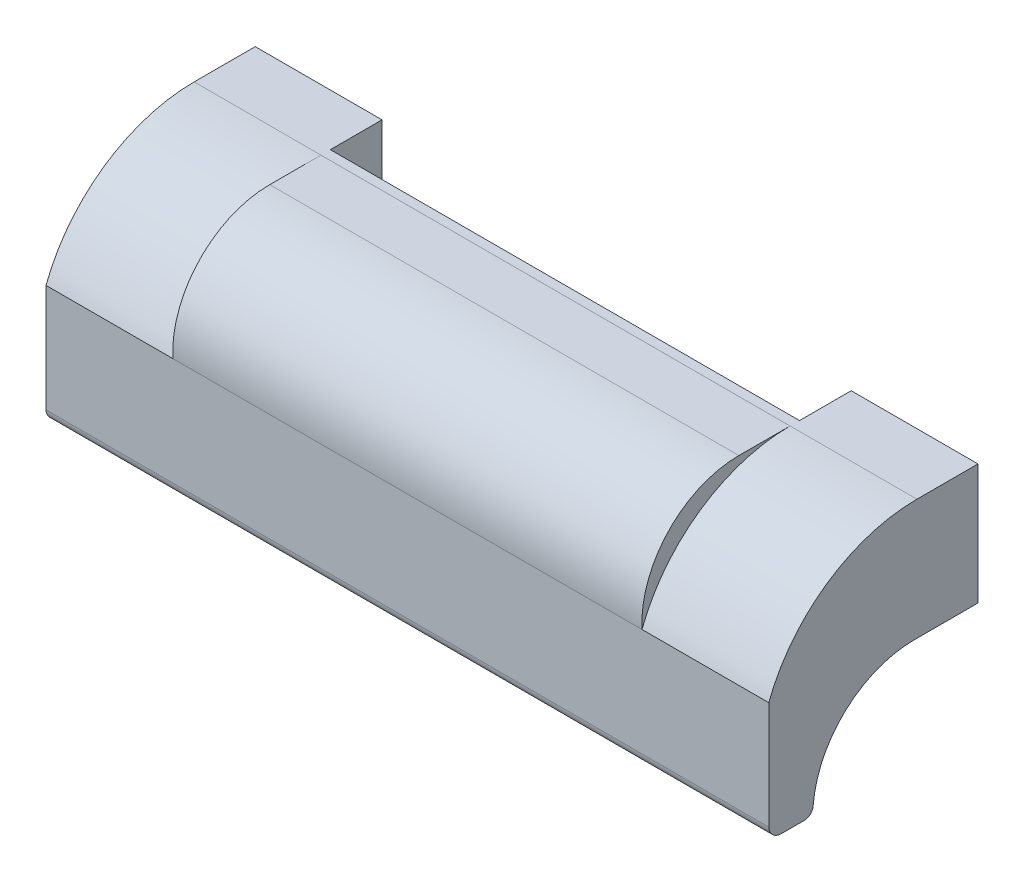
ISO-10303-21;
HEADER;
FILE_DESCRIPTION(('STEP AP214'),'2;1');
FILE_NAME('part.step','',(''),(''),'','','');
FILE_SCHEMA(('AUTOMOTIVE_DESIGN { 1 0 10303 214 1 1 1 1 }'));
ENDSEC;
DATA;
#1=APPLICATION_CONTEXT('core data for automotive mechanical design processes');
#2=APPLICATION_PROTOCOL_DEFINITION('international standard','automotive_design',2000,#1);
#3=PRODUCT_CONTEXT('',#1,'mechanical');
#4=PRODUCT('Part','Part','',(#3));
#5=PRODUCT_RELATED_PRODUCT_CATEGORY('part','',(#4));
#6=PRODUCT_DEFINITION_FORMATION('','',#4);
#7=PRODUCT_DEFINITION_CONTEXT('part definition',#1,'design');
#8=PRODUCT_DEFINITION('design','',#6,#7);
#9=PRODUCT_DEFINITION_SHAPE('','',#8);
#10=(LENGTH_UNIT() NAMED_UNIT(*) SI_UNIT(.MILLI.,.METRE.));
#11=(NAMED_UNIT(*) PLANE_ANGLE_UNIT() SI_UNIT($,.RADIAN.));
#12=(NAMED_UNIT(*) SI_UNIT($,.STERADIAN.) SOLID_ANGLE_UNIT());
#13=UNCERTAINTY_MEASURE_WITH_UNIT(LENGTH_MEASURE(1.E-05),#10,'distance_accuracy_value','');
#14=(GEOMETRIC_REPRESENTATION_CONTEXT(3) GLOBAL_UNCERTAINTY_ASSIGNED_CONTEXT((#13)) GLOBAL_UNIT_ASSIGNED_CONTEXT((#10,
#11,#12)) REPRESENTATION_CONTEXT('',''));
#15=CARTESIAN_POINT('',(0.,0.,0.));
#16=DIRECTION('',(0.,0.,1.));
#17=DIRECTION('',(1.,0.,0.));
#18=AXIS2_PLACEMENT_3D('',#15,#16,#17);
#19=CARTESIAN_POINT('',(-10.25,-9.49999999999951,0.));
#20=DIRECTION('',(0.,0.,-1.));
#21=DIRECTION('',(1.,0.,0.));
#22=AXIS2_PLACEMENT_3D('',#19,#20,#21);
#23=PLANE('',#22);
#24=DIRECTION('',(1.,0.,0.));
#25=VECTOR('',#24,1.);
#26=CARTESIAN_POINT('',(-10.25,-9.49999999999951,0.));
#27=LINE('',#26,#25);
#28=CARTESIAN_POINT('',(83.75,-9.49999999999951,0.));
#29=VERTEX_POINT('',#28);
#30=CARTESIAN_POINT('',(103.75,-9.49999999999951,0.));
#31=VERTEX_POINT('',#30);
#32=EDGE_CURVE('E211',#29,#31,#27,.T.);
#33=ORIENTED_EDGE('',*,*,#32,.F.);
#34=DIRECTION('',(0.,-1.,0.));
#35=VECTOR('',#34,1.);
#36=CARTESIAN_POINT('',(83.75,11.8276139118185,0.));
#37=LINE('',#36,#35);
#38=CARTESIAN_POINT('',(83.75,9.5,0.));
#39=VERTEX_POINT('',#38);
#40=EDGE_CURVE('E504',#39,#29,#37,.T.);
#41=ORIENTED_EDGE('',*,*,#40,.F.);
#42=DIRECTION('',(1.,0.,0.));
#43=VECTOR('',#42,1.);
#44=CARTESIAN_POINT('',(-10.25,9.5,0.));
#45=LINE('',#44,#43);
#46=CARTESIAN_POINT('',(103.75,9.5,0.));
#47=VERTEX_POINT('',#46);
#48=EDGE_CURVE('E210',#39,#47,#45,.T.);
#49=ORIENTED_EDGE('',*,*,#48,.T.);
#50=DIRECTION('',(0.,1.,0.));
#51=VECTOR('',#50,1.);
#52=CARTESIAN_POINT('',(103.75,-9.49999999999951,0.));
#53=LINE('',#52,#51);
#54=EDGE_CURVE('E240',#31,#47,#53,.T.);
#55=ORIENTED_EDGE('',*,*,#54,.F.);
#56=EDGE_LOOP('',(#33,#41,#49,#55));
#57=FACE_BOUND('',#56,.T.);
#58=CARTESIAN_POINT('',(93.5,0.,0.));
#59=DIRECTION('',(0.,0.,1.));
#60=DIRECTION('',(-1.,0.,0.));
#61=AXIS2_PLACEMENT_3D('',#58,#59,#60);
#62=CIRCLE('',#61,3.25);
#63=CARTESIAN_POINT('',(90.25,0.,0.));
#64=VERTEX_POINT('',#63);
#65=EDGE_CURVE('E482',#64,#64,#62,.T.);
#66=ORIENTED_EDGE('',*,*,#65,.T.);
#67=EDGE_LOOP('',(#66));
#68=FACE_BOUND('',#67,.T.);
#69=ADVANCED_FACE('F14',(#57,#68),#23,.T.);
#70=DIRECTION('',(0.,-1.,0.));
#71=VECTOR('',#70,1.);
#72=CARTESIAN_POINT('',(9.75,11.8276139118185,0.));
#73=LINE('',#72,#71);
#74=CARTESIAN_POINT('',(9.75,9.5,0.));
#75=VERTEX_POINT('',#74);
#76=CARTESIAN_POINT('',(9.75,-9.49999999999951,0.));
#77=VERTEX_POINT('',#76);
#78=EDGE_CURVE('E189',#75,#77,#73,.T.);
#79=ORIENTED_EDGE('',*,*,#78,.T.);
#80=CARTESIAN_POINT('',(-10.25,-9.49999999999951,0.));
#81=VERTEX_POINT('',#80);
#82=EDGE_CURVE('E200',#81,#77,#27,.T.);
#83=ORIENTED_EDGE('',*,*,#82,.F.);
#84=DIRECTION('',(0.,1.,0.));
#85=VECTOR('',#84,1.);
#86=CARTESIAN_POINT('',(-10.25,-9.49999999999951,0.));
#87=LINE('',#86,#85);
#88=CARTESIAN_POINT('',(-10.25,9.5,0.));
#89=VERTEX_POINT('',#88);
#90=EDGE_CURVE('E265',#81,#89,#87,.T.);
#91=ORIENTED_EDGE('',*,*,#90,.T.);
#92=EDGE_CURVE('E202',#89,#75,#45,.T.);
#93=ORIENTED_EDGE('',*,*,#92,.T.);
#94=EDGE_LOOP('',(#79,#83,#91,#93));
#95=FACE_BOUND('',#94,.T.);
#96=CARTESIAN_POINT('',(0.,0.,0.));
#97=DIRECTION('',(0.,0.,-1.));
#98=DIRECTION('',(1.,0.,0.));
#99=AXIS2_PLACEMENT_3D('',#96,#97,#98);
#100=CIRCLE('',#99,3.25);
#101=CARTESIAN_POINT('',(3.25,0.,0.));
#102=VERTEX_POINT('',#101);
#103=EDGE_CURVE('E203',#102,#102,#100,.T.);
#104=ORIENTED_EDGE('',*,*,#103,.F.);
#105=EDGE_LOOP('',(#104));
#106=FACE_BOUND('',#105,.T.);
#107=ADVANCED_FACE('F197',(#95,#106),#23,.T.);
#108=CARTESIAN_POINT('',(-10.25,9.5,0.));
#109=DIRECTION('',(0.,1.,0.));
#110=DIRECTION('',(-1.,0.,0.));
#111=AXIS2_PLACEMENT_3D('',#108,#109,#110);
#112=PLANE('',#111);
#113=ORIENTED_EDGE('',*,*,#48,.F.);
#114=DIRECTION('',(0.,0.,1.));
#115=VECTOR('',#114,1.);
#116=CARTESIAN_POINT('',(83.75,9.5,0.));
#117=LINE('',#116,#115);
#118=CARTESIAN_POINT('',(83.75,9.5,8.15107299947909));
#119=VERTEX_POINT('',#118);
#120=EDGE_CURVE('E530',#39,#119,#117,.T.);
#121=ORIENTED_EDGE('',*,*,#120,.T.);
#122=DIRECTION('',(1.,0.,0.));
#123=VECTOR('',#122,1.);
#124=CARTESIAN_POINT('',(-10.25,9.5,8.15107299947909));
#125=LINE('',#124,#123);
#126=CARTESIAN_POINT('',(9.75,9.5,8.15107299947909));
#127=VERTEX_POINT('',#126);
#128=EDGE_CURVE('E9',#127,#119,#125,.T.);
#129=ORIENTED_EDGE('',*,*,#128,.F.);
#130=DIRECTION('',(0.,0.,1.));
#131=VECTOR('',#130,1.);
#132=CARTESIAN_POINT('',(9.75,9.5,0.));
#133=LINE('',#132,#131);
#134=EDGE_CURVE('E528',#75,#127,#133,.T.);
#135=ORIENTED_EDGE('',*,*,#134,.F.);
#136=ORIENTED_EDGE('',*,*,#92,.F.);
#137=DIRECTION('',(0.,0.,1.));
#138=VECTOR('',#137,1.);
#139=CARTESIAN_POINT('',(-10.25,9.5,0.));
#140=LINE('',#139,#138);
#141=CARTESIAN_POINT('',(-10.25,9.5,9.6333620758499));
#142=VERTEX_POINT('',#141);
#143=EDGE_CURVE('E226',#89,#142,#140,.T.);
#144=ORIENTED_EDGE('',*,*,#143,.T.);
#145=DIRECTION('',(1.,0.,0.));
#146=VECTOR('',#145,1.);
#147=CARTESIAN_POINT('',(-10.25,9.5,9.6333620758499));
#148=LINE('',#147,#146);
#149=CARTESIAN_POINT('',(103.75,9.5,9.6333620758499));
#150=VERTEX_POINT('',#149);
#151=EDGE_CURVE('E23',#142,#150,#148,.T.);
#152=ORIENTED_EDGE('',*,*,#151,.T.);
#153=DIRECTION('',(0.,0.,1.));
#154=VECTOR('',#153,1.);
#155=CARTESIAN_POINT('',(103.75,9.5,0.));
#156=LINE('',#155,#154);
#157=EDGE_CURVE('E223',#47,#150,#156,.T.);
#158=ORIENTED_EDGE('',*,*,#157,.F.);
#159=EDGE_LOOP('',(#113,#121,#129,#135,#136,#144,#152,#158));
#160=FACE_BOUND('',#159,.T.);
#161=ADVANCED_FACE('F16',(#160),#112,.T.);
#162=CARTESIAN_POINT('',(-10.25,-9.49999999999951,0.));
#163=DIRECTION('',(0.,1.,0.));
#164=DIRECTION('',(-1.,0.,0.));
#165=AXIS2_PLACEMENT_3D('',#162,#163,#164);
#166=PLANE('',#165);
#167=DIRECTION('',(0.,0.,-1.));
#168=VECTOR('',#167,1.);
#169=CARTESIAN_POINT('',(83.75,-9.5,25.254590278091));
#170=LINE('',#169,#168);
#171=CARTESIAN_POINT('',(83.75,-9.5,25.254590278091));
#172=VERTEX_POINT('',#171);
#173=EDGE_CURVE('E506',#172,#29,#170,.T.);
#174=ORIENTED_EDGE('',*,*,#173,.T.);
#175=ORIENTED_EDGE('',*,*,#32,.T.);
#176=DIRECTION('',(0.,0.,1.));
#177=VECTOR('',#176,1.);
#178=CARTESIAN_POINT('',(103.75,-9.49999999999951,0.));
#179=LINE('',#178,#177);
#180=CARTESIAN_POINT('',(103.75,-9.49999999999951,10.0519430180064));
#181=VERTEX_POINT('',#180);
#182=EDGE_CURVE('E242',#31,#181,#179,.T.);
#183=ORIENTED_EDGE('',*,*,#182,.T.);
#184=DIRECTION('',(1.,0.,0.));
#185=VECTOR('',#184,1.);
#186=CARTESIAN_POINT('',(-10.25,-9.49999999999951,10.0519430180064));
#187=LINE('',#186,#185);
#188=CARTESIAN_POINT('',(101.25,-9.49999999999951,10.0519430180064));
#189=VERTEX_POINT('',#188);
#190=EDGE_CURVE('E293',#189,#181,#187,.T.);
#191=ORIENTED_EDGE('',*,*,#190,.F.);
#192=DIRECTION('',(0.,0.,1.));
#193=VECTOR('',#192,1.);
#194=CARTESIAN_POINT('',(101.25,-9.49999999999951,-0.00996209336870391));
#195=LINE('',#194,#193);
#196=CARTESIAN_POINT('',(101.25,-9.49999999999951,30.));
#197=VERTEX_POINT('',#196);
#198=EDGE_CURVE('E546',#189,#197,#195,.T.);
#199=ORIENTED_EDGE('',*,*,#198,.T.);
#200=DIRECTION('',(-1.,0.,0.));
#201=VECTOR('',#200,1.);
#202=CARTESIAN_POINT('',(101.25,-9.49999999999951,30.));
#203=LINE('',#202,#201);
#204=CARTESIAN_POINT('',(-7.75,-9.49999999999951,30.));
#205=VERTEX_POINT('',#204);
#206=EDGE_CURVE('E324',#197,#205,#203,.T.);
#207=ORIENTED_EDGE('',*,*,#206,.T.);
#208=DIRECTION('',(0.,0.,1.));
#209=VECTOR('',#208,1.);
#210=CARTESIAN_POINT('',(-7.75,-9.49999999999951,-0.00996209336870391));
#211=LINE('',#210,#209);
#212=CARTESIAN_POINT('',(-7.75,-9.49999999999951,10.0519430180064));
#213=VERTEX_POINT('',#212);
#214=EDGE_CURVE('E533',#213,#205,#211,.T.);
#215=ORIENTED_EDGE('',*,*,#214,.F.);
#216=CARTESIAN_POINT('',(-10.25,-9.49999999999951,10.0519430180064));
#217=VERTEX_POINT('',#216);
#218=EDGE_CURVE('E214',#217,#213,#187,.T.);
#219=ORIENTED_EDGE('',*,*,#218,.F.);
#220=DIRECTION('',(0.,0.,1.));
#221=VECTOR('',#220,1.);
#222=CARTESIAN_POINT('',(-10.25,-9.49999999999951,0.));
#223=LINE('',#222,#221);
#224=EDGE_CURVE('E209',#81,#217,#223,.T.);
#225=ORIENTED_EDGE('',*,*,#224,.F.);
#226=ORIENTED_EDGE('',*,*,#82,.T.);
#227=DIRECTION('',(0.,0.,-1.));
#228=VECTOR('',#227,1.);
#229=CARTESIAN_POINT('',(9.75,-9.5,25.254590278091));
#230=LINE('',#229,#228);
#231=CARTESIAN_POINT('',(9.75,-9.49999999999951,25.254590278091));
#232=VERTEX_POINT('',#231);
#233=EDGE_CURVE('E186',#232,#77,#230,.T.);
#234=ORIENTED_EDGE('',*,*,#233,.F.);
#235=DIRECTION('',(-1.,0.,0.));
#236=VECTOR('',#235,1.);
#237=CARTESIAN_POINT('',(83.75,-9.5,25.254590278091));
#238=LINE('',#237,#236);
#239=EDGE_CURVE('E520',#172,#232,#238,.T.);
#240=ORIENTED_EDGE('',*,*,#239,.F.);
#241=EDGE_LOOP('',(#174,#175,#183,#191,#199,#207,#215,#219,#225,#226,#234,#240));
#242=FACE_BOUND('',#241,.T.);
#243=ADVANCED_FACE('F207',(#242),#166,.F.);
#244=CARTESIAN_POINT('',(-10.25,-25.4999999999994,10.0519430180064));
#245=DIRECTION('',(1.,0.,0.));
#246=DIRECTION('',(0.,1.,0.));
#247=AXIS2_PLACEMENT_3D('',#244,#245,#246);
#248=CYLINDRICAL_SURFACE('',#247,16.);
#249=DIRECTION('',(1.,0.,0.));
#250=VECTOR('',#249,1.);
#251=CARTESIAN_POINT('',(-10.25,-24.2117925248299,26.));
#252=LINE('',#251,#250);
#253=CARTESIAN_POINT('',(101.25,-24.2117925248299,26.));
#254=VERTEX_POINT('',#253);
#255=CARTESIAN_POINT('',(103.75,-24.2117925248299,26.));
#256=VERTEX_POINT('',#255);
#257=EDGE_CURVE('E290',#254,#256,#252,.T.);
#258=ORIENTED_EDGE('',*,*,#257,.F.);
#259=CARTESIAN_POINT('',(101.25,-25.4999999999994,10.0519430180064));
#260=DIRECTION('',(-1.,0.,0.));
#261=DIRECTION('',(0.,-1.,0.));
#262=AXIS2_PLACEMENT_3D('',#259,#260,#261);
#263=CIRCLE('',#262,16.);
#264=EDGE_CURVE('E323',#254,#189,#263,.T.);
#265=ORIENTED_EDGE('',*,*,#264,.T.);
#266=ORIENTED_EDGE('',*,*,#190,.T.);
#267=CARTESIAN_POINT('',(103.75,-25.4999999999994,10.0519430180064));
#268=DIRECTION('',(-1.,0.,0.));
#269=DIRECTION('',(0.,-1.,0.));
#270=AXIS2_PLACEMENT_3D('',#267,#268,#269);
#271=CIRCLE('',#270,16.);
#272=EDGE_CURVE('E248',#256,#181,#271,.T.);
#273=ORIENTED_EDGE('',*,*,#272,.F.);
#274=EDGE_LOOP('',(#258,#265,#266,#273));
#275=FACE_BOUND('',#274,.T.);
#276=ADVANCED_FACE('F305',(#275),#248,.F.);
#277=CARTESIAN_POINT('',(-10.25,-15.5,9.6333620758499));
#278=DIRECTION('',(1.,0.,0.));
#279=DIRECTION('',(0.,1.,0.));
#280=AXIS2_PLACEMENT_3D('',#277,#278,#279);
#281=CYLINDRICAL_SURFACE('',#280,25.);
#282=DIRECTION('',(1.,0.,0.));
#283=VECTOR('',#282,1.);
#284=CARTESIAN_POINT('',(-10.25,-6.61179252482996,33.));
#285=LINE('',#284,#283);
#286=CARTESIAN_POINT('',(-10.25,-6.61179252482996,33.));
#287=VERTEX_POINT('',#286);
#288=CARTESIAN_POINT('',(9.75,-6.61179252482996,33.));
#289=VERTEX_POINT('',#288);
#290=EDGE_CURVE('E283',#287,#289,#285,.T.);
#291=ORIENTED_EDGE('',*,*,#290,.T.);
#292=CARTESIAN_POINT('',(9.75,-15.5,9.6333620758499));
#293=DIRECTION('',(-1.,0.,0.));
#294=DIRECTION('',(0.,-1.,0.));
#295=AXIS2_PLACEMENT_3D('',#292,#293,#294);
#296=CIRCLE('',#295,25.);
#297=CARTESIAN_POINT('',(9.75,9.49999752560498,9.64909228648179));
#298=VERTEX_POINT('',#297);
#299=EDGE_CURVE('E42',#289,#298,#296,.T.);
#300=ORIENTED_EDGE('',*,*,#299,.T.);
#301=DIRECTION('',(1.,0.,0.));
#302=VECTOR('',#301,1.);
#303=CARTESIAN_POINT('',(9.75,9.5,9.6490922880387));
#304=LINE('',#303,#302);
#305=CARTESIAN_POINT('',(83.75,9.49999752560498,9.64909228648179));
#306=VERTEX_POINT('',#305);
#307=EDGE_CURVE('E46',#298,#306,#304,.T.);
#308=ORIENTED_EDGE('',*,*,#307,.T.);
#309=CARTESIAN_POINT('',(83.75,-15.5,9.6333620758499));
#310=DIRECTION('',(-1.,0.,0.));
#311=DIRECTION('',(0.,-1.,0.));
#312=AXIS2_PLACEMENT_3D('',#309,#310,#311);
#313=CIRCLE('',#312,25.);
#314=CARTESIAN_POINT('',(83.75,-6.61179252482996,33.));
#315=VERTEX_POINT('',#314);
#316=EDGE_CURVE('E343',#315,#306,#313,.T.);
#317=ORIENTED_EDGE('',*,*,#316,.F.);
#318=CARTESIAN_POINT('',(103.75,-6.61179252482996,33.));
#319=VERTEX_POINT('',#318);
#320=EDGE_CURVE('E232',#315,#319,#285,.T.);
#321=ORIENTED_EDGE('',*,*,#320,.T.);
#322=CARTESIAN_POINT('',(103.75,-15.5,9.6333620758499));
#323=DIRECTION('',(-1.,0.,0.));
#324=DIRECTION('',(0.,-1.,0.));
#325=AXIS2_PLACEMENT_3D('',#322,#323,#324);
#326=CIRCLE('',#325,25.);
#327=EDGE_CURVE('E230',#319,#150,#326,.T.);
#328=ORIENTED_EDGE('',*,*,#327,.T.);
#329=ORIENTED_EDGE('',*,*,#151,.F.);
#330=CARTESIAN_POINT('',(-10.25,-15.5,9.6333620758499));
#331=DIRECTION('',(-1.,0.,0.));
#332=DIRECTION('',(0.,-1.,0.));
#333=AXIS2_PLACEMENT_3D('',#330,#331,#332);
#334=CIRCLE('',#333,25.);
#335=EDGE_CURVE('E262',#287,#142,#334,.T.);
#336=ORIENTED_EDGE('',*,*,#335,.F.);
#337=EDGE_LOOP('',(#291,#300,#308,#317,#321,#328,#329,#336));
#338=FACE_BOUND('',#337,.T.);
#339=ADVANCED_FACE('F231',(#338),#281,.T.);
#340=CARTESIAN_POINT('',(-7.75,-25.4999999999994,10.0519430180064));
#341=DIRECTION('',(-1.,0.,0.));
#342=DIRECTION('',(0.,-1.,0.));
#343=AXIS2_PLACEMENT_3D('',#340,#341,#342);
#344=CIRCLE('',#343,16.);
#345=CARTESIAN_POINT('',(-7.75,-24.2117925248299,26.));
#346=VERTEX_POINT('',#345);
#347=EDGE_CURVE('E319',#346,#213,#344,.T.);
#348=ORIENTED_EDGE('',*,*,#347,.F.);
#349=CARTESIAN_POINT('',(-10.25,-24.2117925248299,26.));
#350=VERTEX_POINT('',#349);
#351=EDGE_CURVE('E291',#350,#346,#252,.T.);
#352=ORIENTED_EDGE('',*,*,#351,.F.);
#353=CARTESIAN_POINT('',(-10.25,-25.4999999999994,10.0519430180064));
#354=DIRECTION('',(-1.,0.,0.));
#355=DIRECTION('',(0.,-1.,0.));
#356=AXIS2_PLACEMENT_3D('',#353,#354,#355);
#357=CIRCLE('',#356,16.);
#358=EDGE_CURVE('E268',#350,#217,#357,.T.);
#359=ORIENTED_EDGE('',*,*,#358,.T.);
#360=ORIENTED_EDGE('',*,*,#218,.T.);
#361=EDGE_LOOP('',(#348,#352,#359,#360));
#362=FACE_BOUND('',#361,.T.);
#363=ADVANCED_FACE('F318',(#362),#248,.F.);
#364=CARTESIAN_POINT('',(-10.25,-24.0989933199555,27.3964583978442));
#365=DIRECTION('',(1.,0.,0.));
#366=DIRECTION('',(0.,1.,0.));
#367=AXIS2_PLACEMENT_3D('',#364,#365,#366);
#368=CYLINDRICAL_SURFACE('',#367,1.40100668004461);
#369=DIRECTION('',(1.,0.,0.));
#370=VECTOR('',#369,1.);
#371=CARTESIAN_POINT('',(-10.25,-25.5,27.3964583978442));
#372=LINE('',#371,#370);
#373=CARTESIAN_POINT('',(-10.25,-25.5,27.3964583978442));
#374=VERTEX_POINT('',#373);
#375=CARTESIAN_POINT('',(103.75,-25.5,27.3964583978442));
#376=VERTEX_POINT('',#375);
#377=EDGE_CURVE('E289',#374,#376,#372,.T.);
#378=ORIENTED_EDGE('',*,*,#377,.F.);
#379=CARTESIAN_POINT('',(-10.25,-24.0989933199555,27.3964583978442));
#380=DIRECTION('',(-1.,0.,0.));
#381=DIRECTION('',(0.,-1.,0.));
#382=AXIS2_PLACEMENT_3D('',#379,#380,#381);
#383=CIRCLE('',#382,1.40100668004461);
#384=EDGE_CURVE('E271',#350,#374,#383,.T.);
#385=ORIENTED_EDGE('',*,*,#384,.F.);
#386=ORIENTED_EDGE('',*,*,#351,.T.);
#387=DIRECTION('',(-1.,0.,0.));
#388=VECTOR('',#387,1.);
#389=CARTESIAN_POINT('',(101.25,-24.2117925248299,26.));
#390=LINE('',#389,#388);
#391=EDGE_CURVE('E302',#254,#346,#390,.T.);
#392=ORIENTED_EDGE('',*,*,#391,.F.);
#393=ORIENTED_EDGE('',*,*,#257,.T.);
#394=CARTESIAN_POINT('',(103.75,-24.0989933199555,27.3964583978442));
#395=DIRECTION('',(-1.,0.,0.));
#396=DIRECTION('',(0.,-1.,0.));
#397=AXIS2_PLACEMENT_3D('',#394,#395,#396);
#398=CIRCLE('',#397,1.40100668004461);
#399=EDGE_CURVE('E251',#256,#376,#398,.T.);
#400=ORIENTED_EDGE('',*,*,#399,.T.);
#401=EDGE_LOOP('',(#378,#385,#386,#392,#393,#400));
#402=FACE_BOUND('',#401,.T.);
#403=ADVANCED_FACE('F299',(#402),#368,.T.);
#404=CARTESIAN_POINT('',(-10.25,-25.5,27.3964583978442));
#405=DIRECTION('',(0.,1.,0.));
#406=DIRECTION('',(-1.,0.,0.));
#407=AXIS2_PLACEMENT_3D('',#404,#405,#406);
#408=PLANE('',#407);
#409=DIRECTION('',(1.,0.,0.));
#410=VECTOR('',#409,1.);
#411=CARTESIAN_POINT('',(-10.25,-25.5,31.0031268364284));
#412=LINE('',#411,#410);
#413=CARTESIAN_POINT('',(-10.25,-25.5,31.0031268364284));
#414=VERTEX_POINT('',#413);
#415=CARTESIAN_POINT('',(103.75,-25.5,31.0031268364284));
#416=VERTEX_POINT('',#415);
#417=EDGE_CURVE('E287',#414,#416,#412,.T.);
#418=ORIENTED_EDGE('',*,*,#417,.F.);
#419=DIRECTION('',(0.,0.,1.));
#420=VECTOR('',#419,1.);
#421=CARTESIAN_POINT('',(-10.25,-25.5,27.3964583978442));
#422=LINE('',#421,#420);
#423=EDGE_CURVE('E274',#374,#414,#422,.T.);
#424=ORIENTED_EDGE('',*,*,#423,.F.);
#425=ORIENTED_EDGE('',*,*,#377,.T.);
#426=DIRECTION('',(0.,0.,1.));
#427=VECTOR('',#426,1.);
#428=CARTESIAN_POINT('',(103.75,-25.5,27.3964583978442));
#429=LINE('',#428,#427);
#430=EDGE_CURVE('E254',#376,#416,#429,.T.);
#431=ORIENTED_EDGE('',*,*,#430,.T.);
#432=EDGE_LOOP('',(#418,#424,#425,#431));
#433=FACE_BOUND('',#432,.T.);
#434=ADVANCED_FACE('F309',(#433),#408,.F.);
#435=CARTESIAN_POINT('',(-10.25,-23.5,31.0031268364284));
#436=DIRECTION('',(1.,0.,0.));
#437=DIRECTION('',(0.,1.,0.));
#438=AXIS2_PLACEMENT_3D('',#435,#436,#437);
#439=CYLINDRICAL_SURFACE('',#438,2.00000000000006);
#440=DIRECTION('',(1.,0.,0.));
#441=VECTOR('',#440,1.);
#442=CARTESIAN_POINT('',(-10.25,-23.61179252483,33.));
#443=LINE('',#442,#441);
#444=CARTESIAN_POINT('',(-10.25,-23.61179252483,33.));
#445=VERTEX_POINT('',#444);
#446=CARTESIAN_POINT('',(103.75,-23.61179252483,33.));
#447=VERTEX_POINT('',#446);
#448=EDGE_CURVE('E285',#445,#447,#443,.T.);
#449=ORIENTED_EDGE('',*,*,#448,.F.);
#450=CARTESIAN_POINT('',(-10.25,-23.5,31.0031268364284));
#451=DIRECTION('',(-1.,0.,0.));
#452=DIRECTION('',(0.,-1.,0.));
#453=AXIS2_PLACEMENT_3D('',#450,#451,#452);
#454=CIRCLE('',#453,2.00000000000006);
#455=EDGE_CURVE('E277',#414,#445,#454,.T.);
#456=ORIENTED_EDGE('',*,*,#455,.F.);
#457=ORIENTED_EDGE('',*,*,#417,.T.);
#458=CARTESIAN_POINT('',(103.75,-23.5,31.0031268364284));
#459=DIRECTION('',(-1.,0.,0.));
#460=DIRECTION('',(0.,-1.,0.));
#461=AXIS2_PLACEMENT_3D('',#458,#459,#460);
#462=CIRCLE('',#461,2.00000000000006);
#463=EDGE_CURVE('E257',#416,#447,#462,.T.);
#464=ORIENTED_EDGE('',*,*,#463,.T.);
#465=EDGE_LOOP('',(#449,#456,#457,#464));
#466=FACE_BOUND('',#465,.T.);
#467=ADVANCED_FACE('F387',(#466),#439,.T.);
#468=CARTESIAN_POINT('',(-10.25,-23.61179252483,33.));
#469=DIRECTION('',(0.,0.,-1.));
#470=DIRECTION('',(1.,0.,0.));
#471=AXIS2_PLACEMENT_3D('',#468,#469,#470);
#472=PLANE('',#471);
#473=DIRECTION('',(0.,1.,0.));
#474=VECTOR('',#473,1.);
#475=CARTESIAN_POINT('',(-10.25,-23.61179252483,33.));
#476=LINE('',#475,#474);
#477=EDGE_CURVE('E280',#445,#287,#476,.T.);
#478=ORIENTED_EDGE('',*,*,#477,.F.);
#479=ORIENTED_EDGE('',*,*,#448,.T.);
#480=DIRECTION('',(0.,1.,0.));
#481=VECTOR('',#480,1.);
#482=CARTESIAN_POINT('',(103.75,-23.61179252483,33.));
#483=LINE('',#482,#481);
#484=EDGE_CURVE('E260',#447,#319,#483,.T.);
#485=ORIENTED_EDGE('',*,*,#484,.T.);
#486=ORIENTED_EDGE('',*,*,#320,.F.);
#487=DIRECTION('',(1.,0.,0.));
#488=VECTOR('',#487,1.);
#489=CARTESIAN_POINT('',(9.75,-6.61179252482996,33.));
#490=LINE('',#489,#488);
#491=EDGE_CURVE('E54',#289,#315,#490,.T.);
#492=ORIENTED_EDGE('',*,*,#491,.F.);
#493=ORIENTED_EDGE('',*,*,#290,.F.);
#494=EDGE_LOOP('',(#478,#479,#485,#486,#492,#493));
#495=FACE_BOUND('',#494,.T.);
#496=ADVANCED_FACE('F390',(#495),#472,.F.);
#497=CARTESIAN_POINT('',(-10.25,-15.5,9.6333620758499));
#498=DIRECTION('',(-1.,0.,0.));
#499=DIRECTION('',(0.,-1.,0.));
#500=AXIS2_PLACEMENT_3D('',#497,#498,#499);
#501=PLANE('',#500);
#502=ORIENTED_EDGE('',*,*,#335,.T.);
#503=ORIENTED_EDGE('',*,*,#143,.F.);
#504=ORIENTED_EDGE('',*,*,#90,.F.);
#505=ORIENTED_EDGE('',*,*,#224,.T.);
#506=ORIENTED_EDGE('',*,*,#358,.F.);
#507=ORIENTED_EDGE('',*,*,#384,.T.);
#508=ORIENTED_EDGE('',*,*,#423,.T.);
#509=ORIENTED_EDGE('',*,*,#455,.T.);
#510=ORIENTED_EDGE('',*,*,#477,.T.);
#511=EDGE_LOOP('',(#502,#503,#504,#505,#506,#507,#508,#509,#510));
#512=FACE_BOUND('',#511,.T.);
#513=ADVANCED_FACE('F313',(#512),#501,.T.);
#514=CARTESIAN_POINT('',(103.75,-15.5,9.6333620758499));
#515=DIRECTION('',(-1.,0.,0.));
#516=DIRECTION('',(0.,-1.,0.));
#517=AXIS2_PLACEMENT_3D('',#514,#515,#516);
#518=PLANE('',#517);
#519=ORIENTED_EDGE('',*,*,#327,.F.);
#520=ORIENTED_EDGE('',*,*,#484,.F.);
#521=ORIENTED_EDGE('',*,*,#463,.F.);
#522=ORIENTED_EDGE('',*,*,#430,.F.);
#523=ORIENTED_EDGE('',*,*,#399,.F.);
#524=ORIENTED_EDGE('',*,*,#272,.T.);
#525=ORIENTED_EDGE('',*,*,#182,.F.);
#526=ORIENTED_EDGE('',*,*,#54,.T.);
#527=ORIENTED_EDGE('',*,*,#157,.T.);
#528=EDGE_LOOP('',(#519,#520,#521,#522,#523,#524,#525,#526,#527));
#529=FACE_BOUND('',#528,.T.);
#530=ADVANCED_FACE('F237',(#529),#518,.F.);
#531=CARTESIAN_POINT('',(9.75,-5.77996517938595,17.742658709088));
#532=DIRECTION('',(-1.,0.,0.));
#533=DIRECTION('',(0.,-1.,0.));
#534=AXIS2_PLACEMENT_3D('',#531,#532,#533);
#535=PLANE('',#534);
#536=ORIENTED_EDGE('',*,*,#299,.F.);
#537=CARTESIAN_POINT('',(9.75,-5.77996517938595,17.742658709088));
#538=DIRECTION('',(-1.,0.,0.));
#539=DIRECTION('',(0.,-1.,0.));
#540=AXIS2_PLACEMENT_3D('',#537,#538,#539);
#541=CIRCLE('',#540,15.28);
#542=CARTESIAN_POINT('',(9.75,9.5,17.7100379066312));
#543=VERTEX_POINT('',#542);
#544=EDGE_CURVE('E337',#289,#543,#541,.T.);
#545=ORIENTED_EDGE('',*,*,#544,.T.);
#546=DIRECTION('',(0.,0.,1.));
#547=VECTOR('',#546,1.);
#548=CARTESIAN_POINT('',(9.75,9.5,9.6490922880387));
#549=LINE('',#548,#547);
#550=EDGE_CURVE('E336',#298,#543,#549,.T.);
#551=ORIENTED_EDGE('',*,*,#550,.F.);
#552=EDGE_LOOP('',(#536,#545,#551));
#553=FACE_BOUND('',#552,.T.);
#554=ADVANCED_FACE('F355',(#553),#535,.T.);
#555=CARTESIAN_POINT('',(83.75,-5.77996517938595,17.742658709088));
#556=DIRECTION('',(-1.,0.,0.));
#557=DIRECTION('',(0.,-1.,0.));
#558=AXIS2_PLACEMENT_3D('',#555,#556,#557);
#559=PLANE('',#558);
#560=CARTESIAN_POINT('',(83.75,-5.77996517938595,17.742658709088));
#561=DIRECTION('',(-1.,0.,0.));
#562=DIRECTION('',(0.,-1.,0.));
#563=AXIS2_PLACEMENT_3D('',#560,#561,#562);
#564=CIRCLE('',#563,15.28);
#565=CARTESIAN_POINT('',(83.75,9.5,17.7100379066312));
#566=VERTEX_POINT('',#565);
#567=EDGE_CURVE('E333',#315,#566,#564,.T.);
#568=ORIENTED_EDGE('',*,*,#567,.F.);
#569=ORIENTED_EDGE('',*,*,#316,.T.);
#570=DIRECTION('',(0.,0.,1.));
#571=VECTOR('',#570,1.);
#572=CARTESIAN_POINT('',(83.75,9.5,9.6490922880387));
#573=LINE('',#572,#571);
#574=EDGE_CURVE('E326',#306,#566,#573,.T.);
#575=ORIENTED_EDGE('',*,*,#574,.T.);
#576=EDGE_LOOP('',(#568,#569,#575));
#577=FACE_BOUND('',#576,.T.);
#578=ADVANCED_FACE('F360',(#577),#559,.F.);
#579=CARTESIAN_POINT('',(9.75,9.5,9.6490922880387));
#580=DIRECTION('',(0.,1.,0.));
#581=DIRECTION('',(-1.,0.,0.));
#582=AXIS2_PLACEMENT_3D('',#579,#580,#581);
#583=PLANE('',#582);
#584=ORIENTED_EDGE('',*,*,#307,.F.);
#585=ORIENTED_EDGE('',*,*,#550,.T.);
#586=DIRECTION('',(1.,0.,0.));
#587=VECTOR('',#586,1.);
#588=CARTESIAN_POINT('',(9.75,9.5,17.7100379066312));
#589=LINE('',#588,#587);
#590=EDGE_CURVE('E340',#543,#566,#589,.T.);
#591=ORIENTED_EDGE('',*,*,#590,.T.);
#592=ORIENTED_EDGE('',*,*,#574,.F.);
#593=EDGE_LOOP('',(#584,#585,#591,#592));
#594=FACE_BOUND('',#593,.T.);
#595=ADVANCED_FACE('F351',(#594),#583,.T.);
#596=CARTESIAN_POINT('',(9.75,-5.77996517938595,17.742658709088));
#597=DIRECTION('',(1.,0.,0.));
#598=DIRECTION('',(0.,1.,0.));
#599=AXIS2_PLACEMENT_3D('',#596,#597,#598);
#600=CYLINDRICAL_SURFACE('',#599,15.28);
#601=ORIENTED_EDGE('',*,*,#544,.F.);
#602=ORIENTED_EDGE('',*,*,#491,.T.);
#603=ORIENTED_EDGE('',*,*,#567,.T.);
#604=ORIENTED_EDGE('',*,*,#590,.F.);
#605=EDGE_LOOP('',(#601,#602,#603,#604));
#606=FACE_BOUND('',#605,.T.);
#607=ADVANCED_FACE('F357',(#606),#600,.T.);
#608=CARTESIAN_POINT('',(101.25,-23.,30.));
#609=DIRECTION('',(0.,0.,1.));
#610=DIRECTION('',(-1.,0.,0.));
#611=AXIS2_PLACEMENT_3D('',#608,#609,#610);
#612=PLANE('',#611);
#613=DIRECTION('',(-1.,0.,0.));
#614=VECTOR('',#613,1.);
#615=CARTESIAN_POINT('',(101.25,-23.,30.));
#616=LINE('',#615,#614);
#617=CARTESIAN_POINT('',(101.25,-23.,30.));
#618=VERTEX_POINT('',#617);
#619=CARTESIAN_POINT('',(-7.75,-23.,30.));
#620=VERTEX_POINT('',#619);
#621=EDGE_CURVE('E329',#618,#620,#616,.T.);
#622=ORIENTED_EDGE('',*,*,#621,.T.);
#623=DIRECTION('',(0.,1.,0.));
#624=VECTOR('',#623,1.);
#625=CARTESIAN_POINT('',(-7.75,-23.,30.));
#626=LINE('',#625,#624);
#627=EDGE_CURVE('E535',#620,#205,#626,.T.);
#628=ORIENTED_EDGE('',*,*,#627,.T.);
#629=ORIENTED_EDGE('',*,*,#206,.F.);
#630=DIRECTION('',(0.,1.,0.));
#631=VECTOR('',#630,1.);
#632=CARTESIAN_POINT('',(101.25,-23.,30.));
#633=LINE('',#632,#631);
#634=EDGE_CURVE('E548',#618,#197,#633,.T.);
#635=ORIENTED_EDGE('',*,*,#634,.F.);
#636=EDGE_LOOP('',(#622,#628,#629,#635));
#637=FACE_BOUND('',#636,.T.);
#638=ADVANCED_FACE('F401',(#637),#612,.F.);
#639=CARTESIAN_POINT('',(101.25,-23.,29.5));
#640=DIRECTION('',(-1.,0.,0.));
#641=DIRECTION('',(0.,-1.,0.));
#642=AXIS2_PLACEMENT_3D('',#639,#640,#641);
#643=CYLINDRICAL_SURFACE('',#642,0.500000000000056);
#644=DIRECTION('',(-1.,0.,0.));
#645=VECTOR('',#644,1.);
#646=CARTESIAN_POINT('',(101.25,-23.5,29.5));
#647=LINE('',#646,#645);
#648=CARTESIAN_POINT('',(101.25,-23.5,29.5));
#649=VERTEX_POINT('',#648);
#650=CARTESIAN_POINT('',(-7.75,-23.5,29.5));
#651=VERTEX_POINT('',#650);
#652=EDGE_CURVE('E562',#649,#651,#647,.T.);
#653=ORIENTED_EDGE('',*,*,#652,.T.);
#654=CARTESIAN_POINT('',(-7.75,-23.,29.5));
#655=DIRECTION('',(-1.,0.,0.));
#656=DIRECTION('',(0.,-1.,0.));
#657=AXIS2_PLACEMENT_3D('',#654,#655,#656);
#658=CIRCLE('',#657,0.500000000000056);
#659=EDGE_CURVE('E538',#651,#620,#658,.T.);
#660=ORIENTED_EDGE('',*,*,#659,.T.);
#661=ORIENTED_EDGE('',*,*,#621,.F.);
#662=CARTESIAN_POINT('',(101.25,-23.,29.5));
#663=DIRECTION('',(-1.,0.,0.));
#664=DIRECTION('',(0.,-1.,0.));
#665=AXIS2_PLACEMENT_3D('',#662,#663,#664);
#666=CIRCLE('',#665,0.500000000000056);
#667=EDGE_CURVE('E551',#649,#618,#666,.T.);
#668=ORIENTED_EDGE('',*,*,#667,.F.);
#669=EDGE_LOOP('',(#653,#660,#661,#668));
#670=FACE_BOUND('',#669,.T.);
#671=ADVANCED_FACE('F405',(#670),#643,.F.);
#672=CARTESIAN_POINT('',(101.25,-23.5,26.7117925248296));
#673=DIRECTION('',(0.,-1.,0.));
#674=DIRECTION('',(0.,0.,1.));
#675=AXIS2_PLACEMENT_3D('',#672,#673,#674);
#676=PLANE('',#675);
#677=DIRECTION('',(-1.,0.,0.));
#678=VECTOR('',#677,1.);
#679=CARTESIAN_POINT('',(101.25,-23.5,26.7117925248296));
#680=LINE('',#679,#678);
#681=CARTESIAN_POINT('',(101.25,-23.5,26.7117925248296));
#682=VERTEX_POINT('',#681);
#683=CARTESIAN_POINT('',(-7.75,-23.5,26.7117925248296));
#684=VERTEX_POINT('',#683);
#685=EDGE_CURVE('E560',#682,#684,#680,.T.);
#686=ORIENTED_EDGE('',*,*,#685,.T.);
#687=DIRECTION('',(0.,0.,1.));
#688=VECTOR('',#687,1.);
#689=CARTESIAN_POINT('',(-7.75,-23.5,26.7117925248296));
#690=LINE('',#689,#688);
#691=EDGE_CURVE('E541',#684,#651,#690,.T.);
#692=ORIENTED_EDGE('',*,*,#691,.T.);
#693=ORIENTED_EDGE('',*,*,#652,.F.);
#694=DIRECTION('',(0.,0.,1.));
#695=VECTOR('',#694,1.);
#696=CARTESIAN_POINT('',(101.25,-23.5,26.7117925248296));
#697=LINE('',#696,#695);
#698=EDGE_CURVE('E554',#682,#649,#697,.T.);
#699=ORIENTED_EDGE('',*,*,#698,.F.);
#700=EDGE_LOOP('',(#686,#692,#693,#699));
#701=FACE_BOUND('',#700,.T.);
#702=ADVANCED_FACE('F410',(#701),#676,.F.);
#703=CARTESIAN_POINT('',(101.25,-24.2117925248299,26.7117925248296));
#704=DIRECTION('',(-1.,0.,0.));
#705=DIRECTION('',(0.,-1.,0.));
#706=AXIS2_PLACEMENT_3D('',#703,#704,#705);
#707=CYLINDRICAL_SURFACE('',#706,0.711792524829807);
#708=CARTESIAN_POINT('',(101.25,-24.2117925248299,26.7117925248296));
#709=DIRECTION('',(-1.,0.,0.));
#710=DIRECTION('',(0.,-1.,0.));
#711=AXIS2_PLACEMENT_3D('',#708,#709,#710);
#712=CIRCLE('',#711,0.711792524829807);
#713=EDGE_CURVE('E557',#682,#254,#712,.T.);
#714=ORIENTED_EDGE('',*,*,#713,.T.);
#715=ORIENTED_EDGE('',*,*,#391,.T.);
#716=CARTESIAN_POINT('',(-7.75,-24.2117925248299,26.7117925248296));
#717=DIRECTION('',(-1.,0.,0.));
#718=DIRECTION('',(0.,-1.,0.));
#719=AXIS2_PLACEMENT_3D('',#716,#717,#718);
#720=CIRCLE('',#719,0.711792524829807);
#721=EDGE_CURVE('E544',#684,#346,#720,.T.);
#722=ORIENTED_EDGE('',*,*,#721,.F.);
#723=ORIENTED_EDGE('',*,*,#685,.F.);
#724=EDGE_LOOP('',(#714,#715,#722,#723));
#725=FACE_BOUND('',#724,.T.);
#726=ADVANCED_FACE('F416',(#725),#707,.T.);
#727=CARTESIAN_POINT('',(101.25,-23.,29.5));
#728=DIRECTION('',(-1.,0.,0.));
#729=DIRECTION('',(0.,-1.,0.));
#730=AXIS2_PLACEMENT_3D('',#727,#728,#729);
#731=PLANE('',#730);
#732=ORIENTED_EDGE('',*,*,#713,.F.);
#733=ORIENTED_EDGE('',*,*,#698,.T.);
#734=ORIENTED_EDGE('',*,*,#667,.T.);
#735=ORIENTED_EDGE('',*,*,#634,.T.);
#736=ORIENTED_EDGE('',*,*,#198,.F.);
#737=ORIENTED_EDGE('',*,*,#264,.F.);
#738=EDGE_LOOP('',(#732,#733,#734,#735,#736,#737));
#739=FACE_BOUND('',#738,.T.);
#740=ADVANCED_FACE('F418',(#739),#731,.T.);
#741=CARTESIAN_POINT('',(-7.75,-23.,29.5));
#742=DIRECTION('',(-1.,0.,0.));
#743=DIRECTION('',(0.,-1.,0.));
#744=AXIS2_PLACEMENT_3D('',#741,#742,#743);
#745=PLANE('',#744);
#746=ORIENTED_EDGE('',*,*,#347,.T.);
#747=ORIENTED_EDGE('',*,*,#214,.T.);
#748=ORIENTED_EDGE('',*,*,#627,.F.);
#749=ORIENTED_EDGE('',*,*,#659,.F.);
#750=ORIENTED_EDGE('',*,*,#691,.F.);
#751=ORIENTED_EDGE('',*,*,#721,.T.);
#752=EDGE_LOOP('',(#746,#747,#748,#749,#750,#751));
#753=FACE_BOUND('',#752,.T.);
#754=ADVANCED_FACE('F422',(#753),#745,.F.);
#755=CARTESIAN_POINT('',(83.75,7.5,8.1401528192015));
#756=DIRECTION('',(0.,-0.00546000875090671,0.999985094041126));
#757=DIRECTION('',(0.,0.999985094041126,0.00546000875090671));
#758=AXIS2_PLACEMENT_3D('',#755,#756,#757);
#759=PLANE('',#758);
#760=ORIENTED_EDGE('',*,*,#128,.T.);
#761=DIRECTION('',(0.,0.999985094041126,0.00546000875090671));
#762=VECTOR('',#761,1.);
#763=CARTESIAN_POINT('',(83.75,7.5,8.1401528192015));
#764=LINE('',#763,#762);
#765=CARTESIAN_POINT('',(83.75,7.5,8.1401528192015));
#766=VERTEX_POINT('',#765);
#767=EDGE_CURVE('E517',#766,#119,#764,.T.);
#768=ORIENTED_EDGE('',*,*,#767,.F.);
#769=DIRECTION('',(-1.,0.,0.));
#770=VECTOR('',#769,1.);
#771=CARTESIAN_POINT('',(83.75,7.5,8.1401528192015));
#772=LINE('',#771,#770);
#773=CARTESIAN_POINT('',(9.75,7.5,8.1401528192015));
#774=VERTEX_POINT('',#773);
#775=EDGE_CURVE('E526',#766,#774,#772,.T.);
#776=ORIENTED_EDGE('',*,*,#775,.T.);
#777=DIRECTION('',(0.,0.999985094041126,0.00546000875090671));
#778=VECTOR('',#777,1.);
#779=CARTESIAN_POINT('',(9.75,7.5,8.1401528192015));
#780=LINE('',#779,#778);
#781=EDGE_CURVE('E501',#774,#127,#780,.T.);
#782=ORIENTED_EDGE('',*,*,#781,.T.);
#783=EDGE_LOOP('',(#760,#768,#776,#782));
#784=FACE_BOUND('',#783,.T.);
#785=ADVANCED_FACE('F428',(#784),#759,.F.);
#786=CARTESIAN_POINT('',(83.75,-15.0463055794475,9.69710648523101));
#787=DIRECTION('',(-1.,0.,0.));
#788=DIRECTION('',(0.,-1.,0.));
#789=AXIS2_PLACEMENT_3D('',#786,#787,#788);
#790=CYLINDRICAL_SURFACE('',#789,22.6);
#791=DIRECTION('',(-1.,0.,0.));
#792=VECTOR('',#791,1.);
#793=CARTESIAN_POINT('',(83.75,-7.49999999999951,31.));
#794=LINE('',#793,#792);
#795=CARTESIAN_POINT('',(83.75,-7.49999999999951,31.));
#796=VERTEX_POINT('',#795);
#797=CARTESIAN_POINT('',(9.75,-7.49999999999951,31.));
#798=VERTEX_POINT('',#797);
#799=EDGE_CURVE('E524',#796,#798,#794,.T.);
#800=ORIENTED_EDGE('',*,*,#799,.T.);
#801=CARTESIAN_POINT('',(9.75,-15.0463055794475,9.69710648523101));
#802=DIRECTION('',(-1.,0.,0.));
#803=DIRECTION('',(0.,-1.,0.));
#804=AXIS2_PLACEMENT_3D('',#801,#802,#803);
#805=CIRCLE('',#804,22.6);
#806=EDGE_CURVE('E498',#798,#774,#805,.T.);
#807=ORIENTED_EDGE('',*,*,#806,.T.);
#808=ORIENTED_EDGE('',*,*,#775,.F.);
#809=CARTESIAN_POINT('',(83.75,-15.0463055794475,9.69710648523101));
#810=DIRECTION('',(-1.,0.,0.));
#811=DIRECTION('',(0.,-1.,0.));
#812=AXIS2_PLACEMENT_3D('',#809,#810,#811);
#813=CIRCLE('',#812,22.6);
#814=EDGE_CURVE('E514',#796,#766,#813,.T.);
#815=ORIENTED_EDGE('',*,*,#814,.F.);
#816=EDGE_LOOP('',(#800,#807,#808,#815));
#817=FACE_BOUND('',#816,.T.);
#818=ADVANCED_FACE('F431',(#817),#790,.F.);
#819=CARTESIAN_POINT('',(83.75,-7.49999999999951,31.));
#820=DIRECTION('',(0.,1.,0.));
#821=DIRECTION('',(-1.,0.,0.));
#822=AXIS2_PLACEMENT_3D('',#819,#820,#821);
#823=PLANE('',#822);
#824=DIRECTION('',(-1.,0.,0.));
#825=VECTOR('',#824,1.);
#826=CARTESIAN_POINT('',(83.75,-7.49999999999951,25.2545902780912));
#827=LINE('',#826,#825);
#828=CARTESIAN_POINT('',(83.75,-7.49999999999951,25.2545902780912));
#829=VERTEX_POINT('',#828);
#830=CARTESIAN_POINT('',(9.75,-7.49999999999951,25.2545902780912));
#831=VERTEX_POINT('',#830);
#832=EDGE_CURVE('E522',#829,#831,#827,.T.);
#833=ORIENTED_EDGE('',*,*,#832,.T.);
#834=DIRECTION('',(0.,0.,-1.));
#835=VECTOR('',#834,1.);
#836=CARTESIAN_POINT('',(9.75,-7.49999999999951,31.));
#837=LINE('',#836,#835);
#838=EDGE_CURVE('E496',#798,#831,#837,.T.);
#839=ORIENTED_EDGE('',*,*,#838,.F.);
#840=ORIENTED_EDGE('',*,*,#799,.F.);
#841=DIRECTION('',(0.,0.,-1.));
#842=VECTOR('',#841,1.);
#843=CARTESIAN_POINT('',(83.75,-7.49999999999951,31.));
#844=LINE('',#843,#842);
#845=EDGE_CURVE('E511',#796,#829,#844,.T.);
#846=ORIENTED_EDGE('',*,*,#845,.T.);
#847=EDGE_LOOP('',(#833,#839,#840,#846));
#848=FACE_BOUND('',#847,.T.);
#849=ADVANCED_FACE('F435',(#848),#823,.T.);
#850=CARTESIAN_POINT('',(83.75,-8.49999999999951,25.2545902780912));
#851=DIRECTION('',(-1.,0.,0.));
#852=DIRECTION('',(0.,-1.,0.));
#853=AXIS2_PLACEMENT_3D('',#850,#851,#852);
#854=CYLINDRICAL_SURFACE('',#853,1.00000000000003);
#855=ORIENTED_EDGE('',*,*,#239,.T.);
#856=CARTESIAN_POINT('',(9.75,-8.49999999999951,25.2545902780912));
#857=DIRECTION('',(-1.,0.,0.));
#858=DIRECTION('',(0.,-1.,0.));
#859=AXIS2_PLACEMENT_3D('',#856,#857,#858);
#860=CIRCLE('',#859,1.00000000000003);
#861=EDGE_CURVE('E31',#831,#232,#860,.T.);
#862=ORIENTED_EDGE('',*,*,#861,.F.);
#863=ORIENTED_EDGE('',*,*,#832,.F.);
#864=CARTESIAN_POINT('',(83.75,-8.49999999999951,25.2545902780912));
#865=DIRECTION('',(-1.,0.,0.));
#866=DIRECTION('',(0.,-1.,0.));
#867=AXIS2_PLACEMENT_3D('',#864,#865,#866);
#868=CIRCLE('',#867,1.00000000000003);
#869=EDGE_CURVE('E508',#829,#172,#868,.T.);
#870=ORIENTED_EDGE('',*,*,#869,.T.);
#871=EDGE_LOOP('',(#855,#862,#863,#870));
#872=FACE_BOUND('',#871,.T.);
#873=ADVANCED_FACE('F439',(#872),#854,.T.);
#874=CARTESIAN_POINT('',(83.75,-8.49999999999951,25.2545902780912));
#875=DIRECTION('',(-1.,0.,0.));
#876=DIRECTION('',(0.,-1.,0.));
#877=AXIS2_PLACEMENT_3D('',#874,#875,#876);
#878=PLANE('',#877);
#879=ORIENTED_EDGE('',*,*,#40,.T.);
#880=ORIENTED_EDGE('',*,*,#173,.F.);
#881=ORIENTED_EDGE('',*,*,#869,.F.);
#882=ORIENTED_EDGE('',*,*,#845,.F.);
#883=ORIENTED_EDGE('',*,*,#814,.T.);
#884=ORIENTED_EDGE('',*,*,#767,.T.);
#885=ORIENTED_EDGE('',*,*,#120,.F.);
#886=EDGE_LOOP('',(#879,#880,#881,#882,#883,#884,#885));
#887=FACE_BOUND('',#886,.T.);
#888=ADVANCED_FACE('F443',(#887),#878,.T.);
#889=CARTESIAN_POINT('',(9.75,-8.49999999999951,25.2545902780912));
#890=DIRECTION('',(-1.,0.,0.));
#891=DIRECTION('',(0.,-1.,0.));
#892=AXIS2_PLACEMENT_3D('',#889,#890,#891);
#893=PLANE('',#892);
#894=ORIENTED_EDGE('',*,*,#134,.T.);
#895=ORIENTED_EDGE('',*,*,#781,.F.);
#896=ORIENTED_EDGE('',*,*,#806,.F.);
#897=ORIENTED_EDGE('',*,*,#838,.T.);
#898=ORIENTED_EDGE('',*,*,#861,.T.);
#899=ORIENTED_EDGE('',*,*,#233,.T.);
#900=ORIENTED_EDGE('',*,*,#78,.F.);
#901=EDGE_LOOP('',(#894,#895,#896,#897,#898,#899,#900));
#902=FACE_BOUND('',#901,.T.);
#903=ADVANCED_FACE('F188',(#902),#893,.F.);
#904=CARTESIAN_POINT('',(0.,0.,0.));
#905=DIRECTION('',(0.,0.,-1.));
#906=DIRECTION('',(1.,0.,0.));
#907=AXIS2_PLACEMENT_3D('',#904,#905,#906);
#908=CYLINDRICAL_SURFACE('',#907,3.25);
#909=ORIENTED_EDGE('',*,*,#103,.T.);
#910=EDGE_LOOP('',(#909));
#911=FACE_BOUND('',#910,.T.);
#912=CARTESIAN_POINT('',(0.,0.,7.42473922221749));
#913=DIRECTION('',(0.,0.,-1.));
#914=DIRECTION('',(1.,0.,0.));
#915=AXIS2_PLACEMENT_3D('',#912,#913,#914);
#916=CIRCLE('',#915,3.25);
#917=CARTESIAN_POINT('',(3.25,0.,7.42473922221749));
#918=VERTEX_POINT('',#917);
#919=EDGE_CURVE('E490',#918,#918,#916,.T.);
#920=ORIENTED_EDGE('',*,*,#919,.F.);
#921=EDGE_LOOP('',(#920));
#922=FACE_BOUND('',#921,.T.);
#923=ADVANCED_FACE('F450',(#911,#922),#908,.F.);
#924=CARTESIAN_POINT('',(0.,0.,11.));
#925=DIRECTION('',(0.,0.,1.));
#926=DIRECTION('',(-1.,0.,0.));
#927=AXIS2_PLACEMENT_3D('',#924,#925,#926);
#928=CONICAL_SURFACE('',#927,6.25,0.698131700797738);
#929=ORIENTED_EDGE('',*,*,#919,.T.);
#930=EDGE_LOOP('',(#929));
#931=FACE_BOUND('',#930,.T.);
#932=CARTESIAN_POINT('',(0.,0.,11.));
#933=DIRECTION('',(0.,0.,-1.));
#934=DIRECTION('',(1.,0.,0.));
#935=AXIS2_PLACEMENT_3D('',#932,#933,#934);
#936=CIRCLE('',#935,6.25);
#937=CARTESIAN_POINT('',(6.25,0.,11.));
#938=VERTEX_POINT('',#937);
#939=EDGE_CURVE('E487',#938,#938,#936,.T.);
#940=ORIENTED_EDGE('',*,*,#939,.F.);
#941=EDGE_LOOP('',(#940));
#942=FACE_BOUND('',#941,.T.);
#943=ADVANCED_FACE('F453',(#931,#942),#928,.F.);
#944=CARTESIAN_POINT('',(0.,-6.25,11.));
#945=DIRECTION('',(0.,0.,1.));
#946=DIRECTION('',(-1.,0.,0.));
#947=AXIS2_PLACEMENT_3D('',#944,#945,#946);
#948=PLANE('',#947);
#949=ORIENTED_EDGE('',*,*,#939,.T.);
#950=EDGE_LOOP('',(#949));
#951=FACE_BOUND('',#950,.T.);
#952=ADVANCED_FACE('F457',(#951),#948,.F.);
#953=CARTESIAN_POINT('',(93.5,0.,0.));
#954=DIRECTION('',(0.,0.,-1.));
#955=DIRECTION('',(-1.,0.,0.));
#956=AXIS2_PLACEMENT_3D('',#953,#954,#955);
#957=CYLINDRICAL_SURFACE('',#956,3.25);
#958=ORIENTED_EDGE('',*,*,#65,.F.);
#959=EDGE_LOOP('',(#958));
#960=FACE_BOUND('',#959,.T.);
#961=CARTESIAN_POINT('',(93.5,0.,7.42473922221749));
#962=DIRECTION('',(0.,0.,1.));
#963=DIRECTION('',(-1.,0.,0.));
#964=AXIS2_PLACEMENT_3D('',#961,#962,#963);
#965=CIRCLE('',#964,3.25);
#966=CARTESIAN_POINT('',(90.25,0.,7.42473922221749));
#967=VERTEX_POINT('',#966);
#968=EDGE_CURVE('E479',#967,#967,#965,.T.);
#969=ORIENTED_EDGE('',*,*,#968,.T.);
#970=EDGE_LOOP('',(#969));
#971=FACE_BOUND('',#970,.T.);
#972=ADVANCED_FACE('F461',(#960,#971),#957,.F.);
#973=CARTESIAN_POINT('',(93.5,0.,11.));
#974=DIRECTION('',(0.,0.,1.));
#975=DIRECTION('',(1.,0.,0.));
#976=AXIS2_PLACEMENT_3D('',#973,#974,#975);
#977=CONICAL_SURFACE('',#976,6.25,0.698131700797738);
#978=ORIENTED_EDGE('',*,*,#968,.F.);
#979=EDGE_LOOP('',(#978));
#980=FACE_BOUND('',#979,.T.);
#981=CARTESIAN_POINT('',(93.5,0.,11.));
#982=DIRECTION('',(0.,0.,1.));
#983=DIRECTION('',(-1.,0.,0.));
#984=AXIS2_PLACEMENT_3D('',#981,#982,#983);
#985=CIRCLE('',#984,6.25);
#986=CARTESIAN_POINT('',(87.25,0.,11.));
#987=VERTEX_POINT('',#986);
#988=EDGE_CURVE('E477',#987,#987,#985,.T.);
#989=ORIENTED_EDGE('',*,*,#988,.T.);
#990=EDGE_LOOP('',(#989));
#991=FACE_BOUND('',#990,.T.);
#992=ADVANCED_FACE('F465',(#980,#991),#977,.F.);
#993=CARTESIAN_POINT('',(93.5,-6.25,11.));
#994=DIRECTION('',(0.,0.,1.));
#995=DIRECTION('',(1.,0.,0.));
#996=AXIS2_PLACEMENT_3D('',#993,#994,#995);
#997=PLANE('',#996);
#998=ORIENTED_EDGE('',*,*,#988,.F.);
#999=EDGE_LOOP('',(#998));
#1000=FACE_BOUND('',#999,.T.);
#1001=ADVANCED_FACE('F469',(#1000),#997,.F.);
#1002=CLOSED_SHELL('',(#69,#107,#161,#243,#276,#339,#363,#403,#434,#467,#496,#513,#530,#554,
#578,#595,#607,#638,#671,#702,#726,#740,#754,#785,#818,#849,#873,#888,#903,#923,#943,#952,#972,
#992,#1001));
#1003=MANIFOLD_SOLID_BREP('B1',#1002);
#1004=ADVANCED_BREP_SHAPE_REPRESENTATION('',(#18,#1003),#14);
#1005=SHAPE_DEFINITION_REPRESENTATION(#9,#1004);
ENDSEC;
END-ISO-10303-21;
